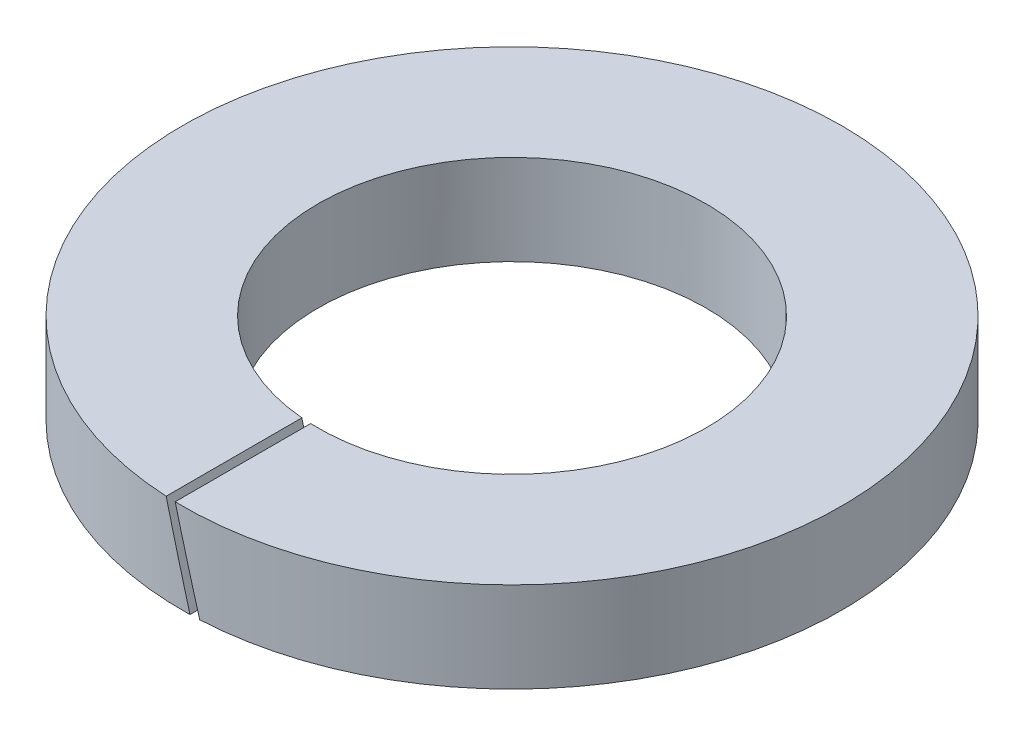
from build123d import *

# Parameters (mm, degrees)
ESQUISSE1_W      = 1.5
ESQUISSE1_H      = 1
FENTE_REACH      = 10.223
FENTE_END_RADIUS = 2.15


with BuildPart() as part:
    # Esquisse1 → Base (revolve)
    with BuildSketch(Plane.XY, mode=Mode.PRIVATE) as base_sk:
        with Locations((2.9, 0.5)):
            Rectangle(ESQUISSE1_W, ESQUISSE1_H)
    revolve(base_sk.sketch.rotate(Axis((0, 0.5, 0), (0, -1, 0)), 90), axis=Axis((0, 0.5, 0), (0, -1, 0)))

    # Fente: up to this cylinder (the profile starts outside it)
    fente_end = Plane(origin=(0, 0.5, 0), z_dir=(0, 1, 0)) * Cylinder(FENTE_END_RADIUS, 25.746, mode=Mode.PRIVATE)
    # Esquisse2 → Fente (cut, up to the surface)
    with BuildSketch(Plane.XY.offset(3.65), mode=Mode.PRIVATE) as fente_sk1:
        Polygon((-0.316245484, 1.487059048), (-0.048296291, 0.487059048), (0.219652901, -0.512940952), (0.316245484, -0.487059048), (0.048296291, 0.512940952), (-0.219652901, 1.512940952), align=None)
    fente_tool1 = extrude(fente_sk1.sketch, amount=-FENTE_REACH, mode=Mode.PRIVATE) - fente_end
    add(fente_tool1.solids().sort_by_distance((0, 0.5, 3.65))[0], mode=Mode.SUBTRACT)


solid = part.part
